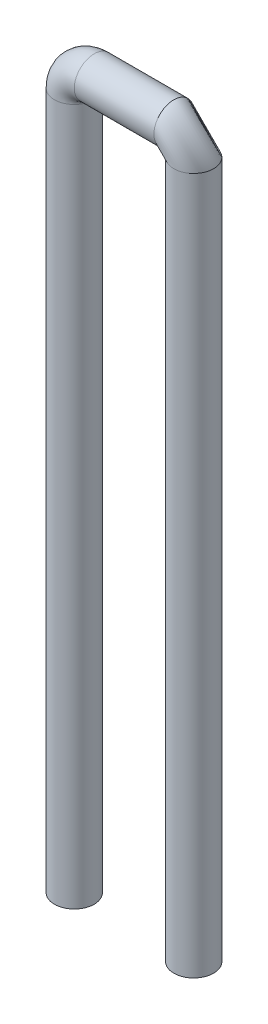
ISO-10303-21;
HEADER;
FILE_DESCRIPTION(('STEP AP214'),'2;1');
FILE_NAME('part.step','',(''),(''),'','','');
FILE_SCHEMA(('AUTOMOTIVE_DESIGN { 1 0 10303 214 1 1 1 1 }'));
ENDSEC;
DATA;
#1=APPLICATION_CONTEXT('core data for automotive mechanical design processes');
#2=APPLICATION_PROTOCOL_DEFINITION('international standard','automotive_design',2000,#1);
#3=PRODUCT_CONTEXT('',#1,'mechanical');
#4=PRODUCT('Part','Part','',(#3));
#5=PRODUCT_RELATED_PRODUCT_CATEGORY('part','',(#4));
#6=PRODUCT_DEFINITION_FORMATION('','',#4);
#7=PRODUCT_DEFINITION_CONTEXT('part definition',#1,'design');
#8=PRODUCT_DEFINITION('design','',#6,#7);
#9=PRODUCT_DEFINITION_SHAPE('','',#8);
#10=(LENGTH_UNIT() NAMED_UNIT(*) SI_UNIT(.MILLI.,.METRE.));
#11=(NAMED_UNIT(*) PLANE_ANGLE_UNIT() SI_UNIT($,.RADIAN.));
#12=(NAMED_UNIT(*) SI_UNIT($,.STERADIAN.) SOLID_ANGLE_UNIT());
#13=UNCERTAINTY_MEASURE_WITH_UNIT(LENGTH_MEASURE(1.E-05),#10,'distance_accuracy_value','');
#14=(GEOMETRIC_REPRESENTATION_CONTEXT(3) GLOBAL_UNCERTAINTY_ASSIGNED_CONTEXT((#13)) GLOBAL_UNIT_ASSIGNED_CONTEXT((#10,
#11,#12)) REPRESENTATION_CONTEXT('',''));
#15=CARTESIAN_POINT('',(0.,0.,0.));
#16=DIRECTION('',(0.,0.,1.));
#17=DIRECTION('',(1.,0.,0.));
#18=AXIS2_PLACEMENT_3D('',#15,#16,#17);
#19=CARTESIAN_POINT('',(3.00000000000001,17.5,0.));
#20=DIRECTION('',(0.,-1.,0.));
#21=DIRECTION('',(1.,0.,0.));
#22=AXIS2_PLACEMENT_3D('',#19,#20,#21);
#23=CYLINDRICAL_SURFACE('',#22,0.5);
#24=CARTESIAN_POINT('',(3.00000000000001,0.,0.));
#25=DIRECTION('',(0.,-1.,0.));
#26=DIRECTION('',(0.,0.,1.));
#27=AXIS2_PLACEMENT_3D('',#24,#25,#26);
#28=CIRCLE('',#27,0.5);
#29=CARTESIAN_POINT('',(3.00000000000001,0.,0.5));
#30=VERTEX_POINT('',#29);
#31=EDGE_CURVE('E11',#30,#30,#28,.T.);
#32=ORIENTED_EDGE('',*,*,#31,.F.);
#33=EDGE_LOOP('',(#32));
#34=FACE_BOUND('',#33,.T.);
#35=CARTESIAN_POINT('',(3.00000000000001,17.5,0.));
#36=DIRECTION('',(0.,-1.,0.));
#37=DIRECTION('',(0.,0.,1.));
#38=AXIS2_PLACEMENT_3D('',#35,#36,#37);
#39=CIRCLE('',#38,0.5);
#40=CARTESIAN_POINT('',(2.5,17.5,0.));
#41=VERTEX_POINT('',#40);
#42=EDGE_CURVE('E38',#41,#41,#39,.T.);
#43=ORIENTED_EDGE('',*,*,#42,.T.);
#44=EDGE_LOOP('',(#43));
#45=FACE_BOUND('',#44,.T.);
#46=ADVANCED_FACE('F31',(#34,#45),#23,.T.);
#47=CARTESIAN_POINT('',(2.5,17.5,0.));
#48=DIRECTION('',(0.,0.,-1.));
#49=DIRECTION('',(-1.,0.,0.));
#50=AXIS2_PLACEMENT_3D('',#47,#48,#49);
#51=TOROIDAL_SURFACE('',#50,0.500000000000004,0.5);
#52=CARTESIAN_POINT('',(2.5,18.,0.));
#53=DIRECTION('',(1.,0.,0.));
#54=DIRECTION('',(0.,0.,1.));
#55=AXIS2_PLACEMENT_3D('',#52,#53,#54);
#56=CIRCLE('',#55,0.5);
#57=EDGE_CURVE('E52',#41,#41,#56,.T.);
#58=ORIENTED_EDGE('',*,*,#57,.T.);
#59=ORIENTED_EDGE('',*,*,#42,.F.);
#60=EDGE_LOOP('',(#58,#59));
#61=FACE_BOUND('',#60,.T.);
#62=ADVANCED_FACE('F64',(#61),#51,.T.);
#63=CARTESIAN_POINT('',(0.500000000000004,18.,0.));
#64=DIRECTION('',(1.,0.,0.));
#65=DIRECTION('',(0.,0.,-1.));
#66=AXIS2_PLACEMENT_3D('',#63,#64,#65);
#67=CYLINDRICAL_SURFACE('',#66,0.5);
#68=ORIENTED_EDGE('',*,*,#57,.F.);
#69=EDGE_LOOP('',(#68));
#70=FACE_BOUND('',#69,.T.);
#71=CARTESIAN_POINT('',(0.500000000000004,18.,0.));
#72=DIRECTION('',(1.,0.,0.));
#73=DIRECTION('',(0.,0.,1.));
#74=AXIS2_PLACEMENT_3D('',#71,#72,#73);
#75=CIRCLE('',#74,0.5);
#76=CARTESIAN_POINT('',(0.5,17.5,0.));
#77=VERTEX_POINT('',#76);
#78=EDGE_CURVE('E47',#77,#77,#75,.T.);
#79=ORIENTED_EDGE('',*,*,#78,.T.);
#80=EDGE_LOOP('',(#79));
#81=FACE_BOUND('',#80,.T.);
#82=ADVANCED_FACE('F49',(#70,#81),#67,.T.);
#83=CARTESIAN_POINT('',(0.,17.5,0.));
#84=DIRECTION('',(0.,-1.,0.));
#85=DIRECTION('',(-1.,0.,0.));
#86=AXIS2_PLACEMENT_3D('',#83,#84,#85);
#87=CIRCLE('',#86,0.5);
#88=TRIMMED_CURVE('',#87,(PARAMETER_VALUE(-3.14159263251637)),
(PARAMETER_VALUE(3.14159263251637)),.T.,.PARAMETER.);
#89=CARTESIAN_POINT('',(0.5,17.5,0.));
#90=DIRECTION('',(0.,0.,-1.));
#91=AXIS1_PLACEMENT('',#89,#90);
#92=SURFACE_OF_REVOLUTION('',#88,#91);
#93=CARTESIAN_POINT('',(0.,17.5,0.));
#94=DIRECTION('',(0.,1.,0.));
#95=DIRECTION('',(0.,0.,1.));
#96=AXIS2_PLACEMENT_3D('',#93,#94,#95);
#97=CIRCLE('',#96,0.5);
#98=EDGE_CURVE('E53',#77,#77,#97,.T.);
#99=ORIENTED_EDGE('',*,*,#98,.T.);
#100=ORIENTED_EDGE('',*,*,#78,.F.);
#101=EDGE_LOOP('',(#99,#100));
#102=FACE_BOUND('',#101,.T.);
#103=ADVANCED_FACE('F55',(#102),#92,.T.);
#104=CARTESIAN_POINT('',(0.,17.5,0.));
#105=DIRECTION('',(0.,-1.,0.));
#106=DIRECTION('',(0.,0.,-1.));
#107=AXIS2_PLACEMENT_3D('',#104,#105,#106);
#108=CYLINDRICAL_SURFACE('',#107,0.5);
#109=ORIENTED_EDGE('',*,*,#98,.F.);
#110=EDGE_LOOP('',(#109));
#111=FACE_BOUND('',#110,.T.);
#112=CARTESIAN_POINT('',(0.,0.,0.));
#113=DIRECTION('',(0.,1.,0.));
#114=DIRECTION('',(0.,0.,1.));
#115=AXIS2_PLACEMENT_3D('',#112,#113,#114);
#116=CIRCLE('',#115,0.5);
#117=CARTESIAN_POINT('',(0.,0.,0.5));
#118=VERTEX_POINT('',#117);
#119=EDGE_CURVE('E57',#118,#118,#116,.T.);
#120=ORIENTED_EDGE('',*,*,#119,.T.);
#121=EDGE_LOOP('',(#120));
#122=FACE_BOUND('',#121,.T.);
#123=ADVANCED_FACE('F72',(#111,#122),#108,.T.);
#124=CARTESIAN_POINT('',(3.00000000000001,0.,0.));
#125=DIRECTION('',(0.,-1.,0.));
#126=DIRECTION('',(0.,0.,1.));
#127=AXIS2_PLACEMENT_3D('',#124,#125,#126);
#128=PLANE('',#127);
#129=ORIENTED_EDGE('',*,*,#31,.T.);
#130=EDGE_LOOP('',(#129));
#131=FACE_BOUND('',#130,.T.);
#132=ADVANCED_FACE('F80',(#131),#128,.T.);
#133=CARTESIAN_POINT('',(0.,0.,0.));
#134=DIRECTION('',(0.,1.,0.));
#135=DIRECTION('',(0.,0.,1.));
#136=AXIS2_PLACEMENT_3D('',#133,#134,#135);
#137=PLANE('',#136);
#138=ORIENTED_EDGE('',*,*,#119,.F.);
#139=EDGE_LOOP('',(#138));
#140=FACE_BOUND('',#139,.T.);
#141=ADVANCED_FACE('F82',(#140),#137,.F.);
#142=CLOSED_SHELL('',(#46,#62,#82,#103,#123,#132,#141));
#143=MANIFOLD_SOLID_BREP('B2',#142);
#144=ADVANCED_BREP_SHAPE_REPRESENTATION('',(#18,#143),#14);
#145=SHAPE_DEFINITION_REPRESENTATION(#9,#144);
ENDSEC;
END-ISO-10303-21;
